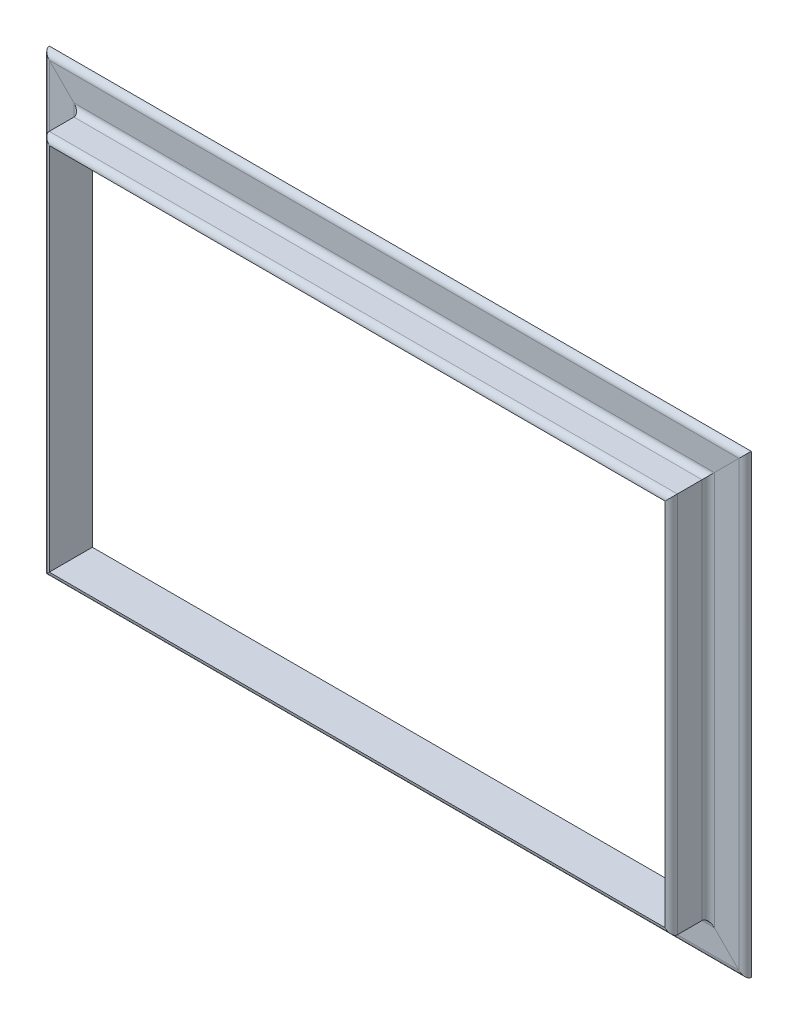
ISO-10303-21;
HEADER;
FILE_DESCRIPTION(('STEP AP214'),'2;1');
FILE_NAME('part.step','',(''),(''),'','','');
FILE_SCHEMA(('AUTOMOTIVE_DESIGN { 1 0 10303 214 1 1 1 1 }'));
ENDSEC;
DATA;
#1=APPLICATION_CONTEXT('core data for automotive mechanical design processes');
#2=APPLICATION_PROTOCOL_DEFINITION('international standard','automotive_design',2000,#1);
#3=PRODUCT_CONTEXT('',#1,'mechanical');
#4=PRODUCT('Part','Part','',(#3));
#5=PRODUCT_RELATED_PRODUCT_CATEGORY('part','',(#4));
#6=PRODUCT_DEFINITION_FORMATION('','',#4);
#7=PRODUCT_DEFINITION_CONTEXT('part definition',#1,'design');
#8=PRODUCT_DEFINITION('design','',#6,#7);
#9=PRODUCT_DEFINITION_SHAPE('','',#8);
#10=(LENGTH_UNIT() NAMED_UNIT(*) SI_UNIT(.MILLI.,.METRE.));
#11=(NAMED_UNIT(*) PLANE_ANGLE_UNIT() SI_UNIT($,.RADIAN.));
#12=(NAMED_UNIT(*) SI_UNIT($,.STERADIAN.) SOLID_ANGLE_UNIT());
#13=UNCERTAINTY_MEASURE_WITH_UNIT(LENGTH_MEASURE(1.E-05),#10,'distance_accuracy_value','');
#14=(GEOMETRIC_REPRESENTATION_CONTEXT(3) GLOBAL_UNCERTAINTY_ASSIGNED_CONTEXT((#13)) GLOBAL_UNIT_ASSIGNED_CONTEXT((#10,
#11,#12)) REPRESENTATION_CONTEXT('',''));
#15=CARTESIAN_POINT('',(0.,0.,0.));
#16=DIRECTION('',(0.,0.,1.));
#17=DIRECTION('',(1.,0.,0.));
#18=AXIS2_PLACEMENT_3D('',#15,#16,#17);
#19=CARTESIAN_POINT('',(-250.,-185.,0.));
#20=DIRECTION('',(0.,0.,1.));
#21=DIRECTION('',(1.,0.,0.));
#22=AXIS2_PLACEMENT_3D('',#19,#20,#21);
#23=PLANE('',#22);
#24=DIRECTION('',(-0.707106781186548,0.707106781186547,0.));
#25=VECTOR('',#24,1.);
#26=CARTESIAN_POINT('',(17.5,82.5,0.));
#27=LINE('',#26,#25);
#28=CARTESIAN_POINT('',(285.,-185.,0.));
#29=VERTEX_POINT('',#28);
#30=CARTESIAN_POINT('',(250.,-150.,0.));
#31=VERTEX_POINT('',#30);
#32=EDGE_CURVE('E142',#29,#31,#27,.T.);
#33=ORIENTED_EDGE('',*,*,#32,.F.);
#34=DIRECTION('',(1.,0.,0.));
#35=VECTOR('',#34,1.);
#36=CARTESIAN_POINT('',(-250.,-185.,0.));
#37=LINE('',#36,#35);
#38=CARTESIAN_POINT('',(-285.,-185.,0.));
#39=VERTEX_POINT('',#38);
#40=EDGE_CURVE('E167',#39,#29,#37,.T.);
#41=ORIENTED_EDGE('',*,*,#40,.F.);
#42=DIRECTION('',(-0.707106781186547,-0.707106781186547,0.));
#43=VECTOR('',#42,1.);
#44=CARTESIAN_POINT('',(-267.5,-167.5,0.));
#45=LINE('',#44,#43);
#46=CARTESIAN_POINT('',(-250.,-150.,0.));
#47=VERTEX_POINT('',#46);
#48=EDGE_CURVE('E133',#47,#39,#45,.T.);
#49=ORIENTED_EDGE('',*,*,#48,.F.);
#50=DIRECTION('',(1.,0.,0.));
#51=VECTOR('',#50,1.);
#52=CARTESIAN_POINT('',(-250.,-150.,0.));
#53=LINE('',#52,#51);
#54=EDGE_CURVE('E76',#47,#31,#53,.T.);
#55=ORIENTED_EDGE('',*,*,#54,.T.);
#56=EDGE_LOOP('',(#33,#41,#49,#55));
#57=FACE_BOUND('',#56,.T.);
#58=ADVANCED_FACE('F72',(#57),#23,.F.);
#59=CARTESIAN_POINT('',(-250.,-180.,0.));
#60=DIRECTION('',(1.,0.,0.));
#61=DIRECTION('',(0.,0.,-1.));
#62=AXIS2_PLACEMENT_3D('',#59,#60,#61);
#63=CYLINDRICAL_SURFACE('',#62,5.);
#64=CARTESIAN_POINT('',(280.,-180.,0.));
#65=DIRECTION('',(0.707106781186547,0.707106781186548,0.));
#66=DIRECTION('',(0.707106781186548,-0.707106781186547,0.));
#67=AXIS2_PLACEMENT_3D('',#64,#65,#66);
#68=ELLIPSE('',#67,7.07106781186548,5.);
#69=CARTESIAN_POINT('',(280.,-180.,5.));
#70=VERTEX_POINT('',#69);
#71=EDGE_CURVE('E139',#70,#29,#68,.T.);
#72=ORIENTED_EDGE('',*,*,#71,.F.);
#73=DIRECTION('',(1.,0.,0.));
#74=VECTOR('',#73,1.);
#75=CARTESIAN_POINT('',(-250.,-180.,5.));
#76=LINE('',#75,#74);
#77=CARTESIAN_POINT('',(-280.,-180.,5.));
#78=VERTEX_POINT('',#77);
#79=EDGE_CURVE('E165',#78,#70,#76,.T.);
#80=ORIENTED_EDGE('',*,*,#79,.F.);
#81=CARTESIAN_POINT('',(-280.,-180.,0.));
#82=DIRECTION('',(-0.707106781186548,0.707106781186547,0.));
#83=DIRECTION('',(0.707106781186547,0.707106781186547,0.));
#84=AXIS2_PLACEMENT_3D('',#81,#82,#83);
#85=ELLIPSE('',#84,7.07106781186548,5.);
#86=EDGE_CURVE('E189',#39,#78,#85,.T.);
#87=ORIENTED_EDGE('',*,*,#86,.F.);
#88=ORIENTED_EDGE('',*,*,#40,.T.);
#89=EDGE_LOOP('',(#72,#80,#87,#88));
#90=FACE_BOUND('',#89,.T.);
#91=ADVANCED_FACE('F181',(#90),#63,.T.);
#92=CARTESIAN_POINT('',(-250.,-160.,5.));
#93=DIRECTION('',(0.,0.,-1.));
#94=DIRECTION('',(0.,1.,0.));
#95=AXIS2_PLACEMENT_3D('',#92,#93,#94);
#96=PLANE('',#95);
#97=DIRECTION('',(0.707106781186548,-0.707106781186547,0.));
#98=VECTOR('',#97,1.);
#99=CARTESIAN_POINT('',(5.00000000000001,95.0000000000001,4.99999999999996));
#100=LINE('',#99,#98);
#101=CARTESIAN_POINT('',(260.,-160.,4.99999999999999));
#102=VERTEX_POINT('',#101);
#103=EDGE_CURVE('E14',#102,#70,#100,.T.);
#104=ORIENTED_EDGE('',*,*,#103,.F.);
#105=DIRECTION('',(1.,0.,0.));
#106=VECTOR('',#105,1.);
#107=CARTESIAN_POINT('',(-250.,-160.,5.));
#108=LINE('',#107,#106);
#109=CARTESIAN_POINT('',(-260.,-160.,5.));
#110=VERTEX_POINT('',#109);
#111=EDGE_CURVE('E162',#110,#102,#108,.T.);
#112=ORIENTED_EDGE('',*,*,#111,.F.);
#113=DIRECTION('',(0.707106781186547,0.707106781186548,0.));
#114=VECTOR('',#113,1.);
#115=CARTESIAN_POINT('',(-255.,-155.,5.));
#116=LINE('',#115,#114);
#117=EDGE_CURVE('E188',#78,#110,#116,.T.);
#118=ORIENTED_EDGE('',*,*,#117,.F.);
#119=ORIENTED_EDGE('',*,*,#79,.T.);
#120=EDGE_LOOP('',(#104,#112,#118,#119));
#121=FACE_BOUND('',#120,.T.);
#122=ADVANCED_FACE('F185',(#121),#96,.F.);
#123=CARTESIAN_POINT('',(-250.,-160.,10.));
#124=DIRECTION('',(1.,0.,0.));
#125=DIRECTION('',(0.,0.,-1.));
#126=AXIS2_PLACEMENT_3D('',#123,#124,#125);
#127=CYLINDRICAL_SURFACE('',#126,5.);
#128=CARTESIAN_POINT('',(260.,-160.,10.));
#129=DIRECTION('',(0.707106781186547,0.707106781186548,0.));
#130=DIRECTION('',(0.707106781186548,-0.707106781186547,0.));
#131=AXIS2_PLACEMENT_3D('',#128,#129,#130);
#132=ELLIPSE('',#131,7.07106781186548,5.);
#133=CARTESIAN_POINT('',(255.,-155.,10.));
#134=VERTEX_POINT('',#133);
#135=EDGE_CURVE('E81',#134,#102,#132,.F.);
#136=ORIENTED_EDGE('',*,*,#135,.F.);
#137=DIRECTION('',(1.,0.,0.));
#138=VECTOR('',#137,1.);
#139=CARTESIAN_POINT('',(-250.,-155.,10.));
#140=LINE('',#139,#138);
#141=CARTESIAN_POINT('',(-255.,-155.,10.));
#142=VERTEX_POINT('',#141);
#143=EDGE_CURVE('E159',#142,#134,#140,.T.);
#144=ORIENTED_EDGE('',*,*,#143,.F.);
#145=CARTESIAN_POINT('',(-260.,-160.,10.));
#146=DIRECTION('',(-0.707106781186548,0.707106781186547,0.));
#147=DIRECTION('',(0.707106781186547,0.707106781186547,0.));
#148=AXIS2_PLACEMENT_3D('',#145,#146,#147);
#149=ELLIPSE('',#148,7.07106781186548,5.);
#150=EDGE_CURVE('E144',#110,#142,#149,.F.);
#151=ORIENTED_EDGE('',*,*,#150,.F.);
#152=ORIENTED_EDGE('',*,*,#111,.T.);
#153=EDGE_LOOP('',(#136,#144,#151,#152));
#154=FACE_BOUND('',#153,.T.);
#155=ADVANCED_FACE('F196',(#154),#127,.F.);
#156=CARTESIAN_POINT('',(-250.,-155.,30.));
#157=DIRECTION('',(0.,1.,0.));
#158=DIRECTION('',(0.,0.,1.));
#159=AXIS2_PLACEMENT_3D('',#156,#157,#158);
#160=PLANE('',#159);
#161=DIRECTION('',(0.,0.,-1.));
#162=VECTOR('',#161,1.);
#163=CARTESIAN_POINT('',(255.,-155.,30.));
#164=LINE('',#163,#162);
#165=CARTESIAN_POINT('',(255.,-155.,30.));
#166=VERTEX_POINT('',#165);
#167=EDGE_CURVE('E153',#166,#134,#164,.T.);
#168=ORIENTED_EDGE('',*,*,#167,.F.);
#169=DIRECTION('',(1.,0.,0.));
#170=VECTOR('',#169,1.);
#171=CARTESIAN_POINT('',(-250.,-155.,30.));
#172=LINE('',#171,#170);
#173=CARTESIAN_POINT('',(-255.,-155.,30.));
#174=VERTEX_POINT('',#173);
#175=EDGE_CURVE('E127',#174,#166,#172,.T.);
#176=ORIENTED_EDGE('',*,*,#175,.F.);
#177=DIRECTION('',(0.,0.,1.));
#178=VECTOR('',#177,1.);
#179=CARTESIAN_POINT('',(-255.,-155.,30.));
#180=LINE('',#179,#178);
#181=EDGE_CURVE('E138',#142,#174,#180,.T.);
#182=ORIENTED_EDGE('',*,*,#181,.F.);
#183=ORIENTED_EDGE('',*,*,#143,.T.);
#184=EDGE_LOOP('',(#168,#176,#182,#183));
#185=FACE_BOUND('',#184,.T.);
#186=ADVANCED_FACE('F199',(#185),#160,.F.);
#187=CARTESIAN_POINT('',(-250.,-150.,30.));
#188=DIRECTION('',(1.,0.,0.));
#189=DIRECTION('',(0.,0.,-1.));
#190=AXIS2_PLACEMENT_3D('',#187,#188,#189);
#191=CYLINDRICAL_SURFACE('',#190,5.);
#192=CARTESIAN_POINT('',(250.,-150.,30.));
#193=DIRECTION('',(0.707106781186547,0.707106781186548,0.));
#194=DIRECTION('',(0.707106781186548,-0.707106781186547,0.));
#195=AXIS2_PLACEMENT_3D('',#192,#193,#194);
#196=ELLIPSE('',#195,7.07106781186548,5.);
#197=CARTESIAN_POINT('',(250.,-150.,35.));
#198=VERTEX_POINT('',#197);
#199=EDGE_CURVE('E124',#198,#166,#196,.T.);
#200=ORIENTED_EDGE('',*,*,#199,.F.);
#201=DIRECTION('',(1.,0.,0.));
#202=VECTOR('',#201,1.);
#203=CARTESIAN_POINT('',(-250.,-150.,35.));
#204=LINE('',#203,#202);
#205=CARTESIAN_POINT('',(-250.,-150.,35.));
#206=VERTEX_POINT('',#205);
#207=EDGE_CURVE('E89',#206,#198,#204,.T.);
#208=ORIENTED_EDGE('',*,*,#207,.F.);
#209=CARTESIAN_POINT('',(-250.,-150.,30.));
#210=DIRECTION('',(-0.707106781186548,0.707106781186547,0.));
#211=DIRECTION('',(0.707106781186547,0.707106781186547,0.));
#212=AXIS2_PLACEMENT_3D('',#209,#210,#211);
#213=ELLIPSE('',#212,7.07106781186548,5.);
#214=EDGE_CURVE('E121',#174,#206,#213,.T.);
#215=ORIENTED_EDGE('',*,*,#214,.F.);
#216=ORIENTED_EDGE('',*,*,#175,.T.);
#217=EDGE_LOOP('',(#200,#208,#215,#216));
#218=FACE_BOUND('',#217,.T.);
#219=ADVANCED_FACE('F118',(#218),#191,.T.);
#220=CARTESIAN_POINT('',(-250.,-150.,0.));
#221=DIRECTION('',(0.,-1.,0.));
#222=DIRECTION('',(0.,0.,-1.));
#223=AXIS2_PLACEMENT_3D('',#220,#221,#222);
#224=PLANE('',#223);
#225=DIRECTION('',(0.,0.,1.));
#226=VECTOR('',#225,1.);
#227=CARTESIAN_POINT('',(250.,-150.,0.));
#228=LINE('',#227,#226);
#229=EDGE_CURVE('E149',#31,#198,#228,.T.);
#230=ORIENTED_EDGE('',*,*,#229,.F.);
#231=ORIENTED_EDGE('',*,*,#54,.F.);
#232=DIRECTION('',(0.,0.,-1.));
#233=VECTOR('',#232,1.);
#234=CARTESIAN_POINT('',(-250.,-150.,0.));
#235=LINE('',#234,#233);
#236=EDGE_CURVE('E126',#206,#47,#235,.T.);
#237=ORIENTED_EDGE('',*,*,#236,.F.);
#238=ORIENTED_EDGE('',*,*,#207,.T.);
#239=EDGE_LOOP('',(#230,#231,#237,#238));
#240=FACE_BOUND('',#239,.T.);
#241=ADVANCED_FACE('F130',(#240),#224,.F.);
#242=CARTESIAN_POINT('',(-250.,-150.,0.));
#243=DIRECTION('',(-0.707106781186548,0.707106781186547,0.));
#244=DIRECTION('',(-0.707106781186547,-0.707106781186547,0.));
#245=AXIS2_PLACEMENT_3D('',#242,#243,#244);
#246=PLANE('',#245);
#247=ORIENTED_EDGE('',*,*,#236,.T.);
#248=ORIENTED_EDGE('',*,*,#48,.T.);
#249=ORIENTED_EDGE('',*,*,#86,.T.);
#250=ORIENTED_EDGE('',*,*,#117,.T.);
#251=ORIENTED_EDGE('',*,*,#150,.T.);
#252=ORIENTED_EDGE('',*,*,#181,.T.);
#253=ORIENTED_EDGE('',*,*,#214,.T.);
#254=EDGE_LOOP('',(#247,#248,#249,#250,#251,#252,#253));
#255=FACE_BOUND('',#254,.T.);
#256=ADVANCED_FACE('F136',(#255),#246,.T.);
#257=CARTESIAN_POINT('',(250.,-150.,0.));
#258=DIRECTION('',(0.707106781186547,0.707106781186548,0.));
#259=DIRECTION('',(-0.707106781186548,0.707106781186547,0.));
#260=AXIS2_PLACEMENT_3D('',#257,#258,#259);
#261=PLANE('',#260);
#262=ORIENTED_EDGE('',*,*,#71,.T.);
#263=ORIENTED_EDGE('',*,*,#32,.T.);
#264=ORIENTED_EDGE('',*,*,#229,.T.);
#265=ORIENTED_EDGE('',*,*,#199,.T.);
#266=ORIENTED_EDGE('',*,*,#167,.T.);
#267=ORIENTED_EDGE('',*,*,#135,.T.);
#268=ORIENTED_EDGE('',*,*,#103,.T.);
#269=EDGE_LOOP('',(#262,#263,#264,#265,#266,#267,#268));
#270=FACE_BOUND('',#269,.T.);
#271=ADVANCED_FACE('F74',(#270),#261,.T.);
#272=CLOSED_SHELL('',(#58,#91,#122,#155,#186,#219,#241,#256,#271));
#273=MANIFOLD_SOLID_BREP('B2',#272);
#274=CARTESIAN_POINT('',(285.,-150.,0.));
#275=DIRECTION('',(0.,0.,1.));
#276=DIRECTION('',(1.,0.,0.));
#277=AXIS2_PLACEMENT_3D('',#274,#275,#276);
#278=PLANE('',#277);
#279=DIRECTION('',(0.707106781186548,-0.707106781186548,0.));
#280=VECTOR('',#279,1.);
#281=CARTESIAN_POINT('',(267.5,-167.5,0.));
#282=LINE('',#281,#280);
#283=CARTESIAN_POINT('',(250.,-150.,0.));
#284=VERTEX_POINT('',#283);
#285=CARTESIAN_POINT('',(285.,-185.,0.));
#286=VERTEX_POINT('',#285);
#287=EDGE_CURVE('E408',#284,#286,#282,.T.);
#288=ORIENTED_EDGE('',*,*,#287,.F.);
#289=DIRECTION('',(0.,1.,0.));
#290=VECTOR('',#289,1.);
#291=CARTESIAN_POINT('',(250.,-150.,0.));
#292=LINE('',#291,#290);
#293=CARTESIAN_POINT('',(250.,150.,0.));
#294=VERTEX_POINT('',#293);
#295=EDGE_CURVE('E322',#284,#294,#292,.T.);
#296=ORIENTED_EDGE('',*,*,#295,.T.);
#297=DIRECTION('',(-0.707106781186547,-0.707106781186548,0.));
#298=VECTOR('',#297,1.);
#299=CARTESIAN_POINT('',(117.5,17.5,0.));
#300=LINE('',#299,#298);
#301=CARTESIAN_POINT('',(285.,185.,0.));
#302=VERTEX_POINT('',#301);
#303=EDGE_CURVE('E425',#302,#294,#300,.T.);
#304=ORIENTED_EDGE('',*,*,#303,.F.);
#305=DIRECTION('',(0.,1.,0.));
#306=VECTOR('',#305,1.);
#307=CARTESIAN_POINT('',(285.,-150.,0.));
#308=LINE('',#307,#306);
#309=EDGE_CURVE('E419',#286,#302,#308,.T.);
#310=ORIENTED_EDGE('',*,*,#309,.F.);
#311=EDGE_LOOP('',(#288,#296,#304,#310));
#312=FACE_BOUND('',#311,.T.);
#313=ADVANCED_FACE('F318',(#312),#278,.F.);
#314=CARTESIAN_POINT('',(280.,-150.,0.));
#315=DIRECTION('',(0.,1.,0.));
#316=DIRECTION('',(0.,0.,1.));
#317=AXIS2_PLACEMENT_3D('',#314,#315,#316);
#318=CYLINDRICAL_SURFACE('',#317,5.);
#319=CARTESIAN_POINT('',(280.,-180.,0.));
#320=DIRECTION('',(-0.707106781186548,-0.707106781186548,0.));
#321=DIRECTION('',(-0.707106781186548,0.707106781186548,0.));
#322=AXIS2_PLACEMENT_3D('',#319,#320,#321);
#323=ELLIPSE('',#322,7.07106781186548,5.);
#324=CARTESIAN_POINT('',(280.,-180.,5.));
#325=VERTEX_POINT('',#324);
#326=EDGE_CURVE('E373',#286,#325,#323,.T.);
#327=ORIENTED_EDGE('',*,*,#326,.F.);
#328=ORIENTED_EDGE('',*,*,#309,.T.);
#329=CARTESIAN_POINT('',(280.,180.,0.));
#330=DIRECTION('',(-0.707106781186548,0.707106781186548,0.));
#331=DIRECTION('',(0.707106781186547,0.707106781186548,0.));
#332=AXIS2_PLACEMENT_3D('',#329,#330,#331);
#333=ELLIPSE('',#332,7.07106781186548,5.);
#334=CARTESIAN_POINT('',(280.,180.,5.));
#335=VERTEX_POINT('',#334);
#336=EDGE_CURVE('E415',#335,#302,#333,.T.);
#337=ORIENTED_EDGE('',*,*,#336,.F.);
#338=DIRECTION('',(0.,1.,0.));
#339=VECTOR('',#338,1.);
#340=CARTESIAN_POINT('',(280.,-150.,5.));
#341=LINE('',#340,#339);
#342=EDGE_CURVE('E418',#325,#335,#341,.T.);
#343=ORIENTED_EDGE('',*,*,#342,.F.);
#344=EDGE_LOOP('',(#327,#328,#337,#343));
#345=FACE_BOUND('',#344,.T.);
#346=ADVANCED_FACE('F421',(#345),#318,.T.);
#347=CARTESIAN_POINT('',(260.,-150.,5.));
#348=DIRECTION('',(0.,0.,-1.));
#349=DIRECTION('',(-1.,0.,0.));
#350=AXIS2_PLACEMENT_3D('',#347,#348,#349);
#351=PLANE('',#350);
#352=DIRECTION('',(-0.707106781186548,0.707106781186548,0.));
#353=VECTOR('',#352,1.);
#354=CARTESIAN_POINT('',(255.,-155.,5.));
#355=LINE('',#354,#353);
#356=CARTESIAN_POINT('',(260.,-160.,4.99999999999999));
#357=VERTEX_POINT('',#356);
#358=EDGE_CURVE('E403',#325,#357,#355,.T.);
#359=ORIENTED_EDGE('',*,*,#358,.F.);
#360=ORIENTED_EDGE('',*,*,#342,.T.);
#361=DIRECTION('',(0.707106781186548,0.707106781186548,0.));
#362=VECTOR('',#361,1.);
#363=CARTESIAN_POINT('',(105.,4.99999999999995,4.99999999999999));
#364=LINE('',#363,#362);
#365=CARTESIAN_POINT('',(260.,160.,4.99999999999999));
#366=VERTEX_POINT('',#365);
#367=EDGE_CURVE('E413',#366,#335,#364,.T.);
#368=ORIENTED_EDGE('',*,*,#367,.F.);
#369=DIRECTION('',(0.,1.,0.));
#370=VECTOR('',#369,1.);
#371=CARTESIAN_POINT('',(260.,-150.,4.99999999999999));
#372=LINE('',#371,#370);
#373=EDGE_CURVE('E399',#357,#366,#372,.T.);
#374=ORIENTED_EDGE('',*,*,#373,.F.);
#375=EDGE_LOOP('',(#359,#360,#368,#374));
#376=FACE_BOUND('',#375,.T.);
#377=ADVANCED_FACE('F456',(#376),#351,.F.);
#378=CARTESIAN_POINT('',(260.,-150.,10.));
#379=DIRECTION('',(0.,1.,0.));
#380=DIRECTION('',(0.,0.,1.));
#381=AXIS2_PLACEMENT_3D('',#378,#379,#380);
#382=CYLINDRICAL_SURFACE('',#381,5.);
#383=CARTESIAN_POINT('',(260.,-160.,10.));
#384=DIRECTION('',(-0.707106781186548,-0.707106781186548,0.));
#385=DIRECTION('',(-0.707106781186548,0.707106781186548,0.));
#386=AXIS2_PLACEMENT_3D('',#383,#384,#385);
#387=ELLIPSE('',#386,7.07106781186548,5.);
#388=CARTESIAN_POINT('',(255.,-155.,10.));
#389=VERTEX_POINT('',#388);
#390=EDGE_CURVE('E391',#357,#389,#387,.F.);
#391=ORIENTED_EDGE('',*,*,#390,.F.);
#392=ORIENTED_EDGE('',*,*,#373,.T.);
#393=CARTESIAN_POINT('',(260.,160.,10.));
#394=DIRECTION('',(-0.707106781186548,0.707106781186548,0.));
#395=DIRECTION('',(0.707106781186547,0.707106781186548,0.));
#396=AXIS2_PLACEMENT_3D('',#393,#394,#395);
#397=ELLIPSE('',#396,7.07106781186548,5.);
#398=CARTESIAN_POINT('',(255.,155.,10.));
#399=VERTEX_POINT('',#398);
#400=EDGE_CURVE('E397',#399,#366,#397,.F.);
#401=ORIENTED_EDGE('',*,*,#400,.F.);
#402=DIRECTION('',(0.,1.,0.));
#403=VECTOR('',#402,1.);
#404=CARTESIAN_POINT('',(255.,-150.,10.));
#405=LINE('',#404,#403);
#406=EDGE_CURVE('E386',#389,#399,#405,.T.);
#407=ORIENTED_EDGE('',*,*,#406,.F.);
#408=EDGE_LOOP('',(#391,#392,#401,#407));
#409=FACE_BOUND('',#408,.T.);
#410=ADVANCED_FACE('F394',(#409),#382,.F.);
#411=CARTESIAN_POINT('',(255.,-150.,30.));
#412=DIRECTION('',(-1.,0.,0.));
#413=DIRECTION('',(0.,0.,1.));
#414=AXIS2_PLACEMENT_3D('',#411,#412,#413);
#415=PLANE('',#414);
#416=DIRECTION('',(0.,0.,1.));
#417=VECTOR('',#416,1.);
#418=CARTESIAN_POINT('',(255.,-155.,30.));
#419=LINE('',#418,#417);
#420=CARTESIAN_POINT('',(255.,-155.,30.));
#421=VERTEX_POINT('',#420);
#422=EDGE_CURVE('E327',#389,#421,#419,.T.);
#423=ORIENTED_EDGE('',*,*,#422,.F.);
#424=ORIENTED_EDGE('',*,*,#406,.T.);
#425=DIRECTION('',(0.,0.,-1.));
#426=VECTOR('',#425,1.);
#427=CARTESIAN_POINT('',(255.,155.,30.));
#428=LINE('',#427,#426);
#429=CARTESIAN_POINT('',(255.,155.,30.));
#430=VERTEX_POINT('',#429);
#431=EDGE_CURVE('E436',#430,#399,#428,.T.);
#432=ORIENTED_EDGE('',*,*,#431,.F.);
#433=DIRECTION('',(0.,1.,0.));
#434=VECTOR('',#433,1.);
#435=CARTESIAN_POINT('',(255.,-150.,30.));
#436=LINE('',#435,#434);
#437=EDGE_CURVE('E388',#421,#430,#436,.T.);
#438=ORIENTED_EDGE('',*,*,#437,.F.);
#439=EDGE_LOOP('',(#423,#424,#432,#438));
#440=FACE_BOUND('',#439,.T.);
#441=ADVANCED_FACE('F384',(#440),#415,.F.);
#442=CARTESIAN_POINT('',(250.,-150.,30.));
#443=DIRECTION('',(0.,1.,0.));
#444=DIRECTION('',(0.,0.,1.));
#445=AXIS2_PLACEMENT_3D('',#442,#443,#444);
#446=CYLINDRICAL_SURFACE('',#445,5.);
#447=CARTESIAN_POINT('',(250.,-150.,30.));
#448=DIRECTION('',(-0.707106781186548,-0.707106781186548,0.));
#449=DIRECTION('',(-0.707106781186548,0.707106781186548,0.));
#450=AXIS2_PLACEMENT_3D('',#447,#448,#449);
#451=ELLIPSE('',#450,7.07106781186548,5.);
#452=CARTESIAN_POINT('',(250.,-150.,35.));
#453=VERTEX_POINT('',#452);
#454=EDGE_CURVE('E70',#421,#453,#451,.T.);
#455=ORIENTED_EDGE('',*,*,#454,.F.);
#456=ORIENTED_EDGE('',*,*,#437,.T.);
#457=CARTESIAN_POINT('',(250.,150.,30.));
#458=DIRECTION('',(-0.707106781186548,0.707106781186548,0.));
#459=DIRECTION('',(0.707106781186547,0.707106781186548,0.));
#460=AXIS2_PLACEMENT_3D('',#457,#458,#459);
#461=ELLIPSE('',#460,7.07106781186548,5.);
#462=CARTESIAN_POINT('',(250.,150.,35.));
#463=VERTEX_POINT('',#462);
#464=EDGE_CURVE('E438',#463,#430,#461,.T.);
#465=ORIENTED_EDGE('',*,*,#464,.F.);
#466=DIRECTION('',(0.,1.,0.));
#467=VECTOR('',#466,1.);
#468=CARTESIAN_POINT('',(250.,-150.,35.));
#469=LINE('',#468,#467);
#470=EDGE_CURVE('E340',#453,#463,#469,.T.);
#471=ORIENTED_EDGE('',*,*,#470,.F.);
#472=EDGE_LOOP('',(#455,#456,#465,#471));
#473=FACE_BOUND('',#472,.T.);
#474=ADVANCED_FACE('F443',(#473),#446,.T.);
#475=CARTESIAN_POINT('',(250.,-150.,0.));
#476=DIRECTION('',(1.,0.,0.));
#477=DIRECTION('',(0.,0.,-1.));
#478=AXIS2_PLACEMENT_3D('',#475,#476,#477);
#479=PLANE('',#478);
#480=DIRECTION('',(0.,0.,-1.));
#481=VECTOR('',#480,1.);
#482=CARTESIAN_POINT('',(250.,-150.,0.));
#483=LINE('',#482,#481);
#484=EDGE_CURVE('E411',#453,#284,#483,.T.);
#485=ORIENTED_EDGE('',*,*,#484,.F.);
#486=ORIENTED_EDGE('',*,*,#470,.T.);
#487=DIRECTION('',(0.,0.,1.));
#488=VECTOR('',#487,1.);
#489=CARTESIAN_POINT('',(250.,150.,0.));
#490=LINE('',#489,#488);
#491=EDGE_CURVE('E428',#294,#463,#490,.T.);
#492=ORIENTED_EDGE('',*,*,#491,.F.);
#493=ORIENTED_EDGE('',*,*,#295,.F.);
#494=EDGE_LOOP('',(#485,#486,#492,#493));
#495=FACE_BOUND('',#494,.T.);
#496=ADVANCED_FACE('F441',(#495),#479,.F.);
#497=CARTESIAN_POINT('',(250.,150.,0.));
#498=DIRECTION('',(-0.707106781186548,0.707106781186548,0.));
#499=DIRECTION('',(-0.707106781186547,-0.707106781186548,0.));
#500=AXIS2_PLACEMENT_3D('',#497,#498,#499);
#501=PLANE('',#500);
#502=ORIENTED_EDGE('',*,*,#336,.T.);
#503=ORIENTED_EDGE('',*,*,#303,.T.);
#504=ORIENTED_EDGE('',*,*,#491,.T.);
#505=ORIENTED_EDGE('',*,*,#464,.T.);
#506=ORIENTED_EDGE('',*,*,#431,.T.);
#507=ORIENTED_EDGE('',*,*,#400,.T.);
#508=ORIENTED_EDGE('',*,*,#367,.T.);
#509=EDGE_LOOP('',(#502,#503,#504,#505,#506,#507,#508));
#510=FACE_BOUND('',#509,.T.);
#511=ADVANCED_FACE('F430',(#510),#501,.T.);
#512=CARTESIAN_POINT('',(250.,-150.,0.));
#513=DIRECTION('',(-0.707106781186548,-0.707106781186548,0.));
#514=DIRECTION('',(0.707106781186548,-0.707106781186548,0.));
#515=AXIS2_PLACEMENT_3D('',#512,#513,#514);
#516=PLANE('',#515);
#517=ORIENTED_EDGE('',*,*,#484,.T.);
#518=ORIENTED_EDGE('',*,*,#287,.T.);
#519=ORIENTED_EDGE('',*,*,#326,.T.);
#520=ORIENTED_EDGE('',*,*,#358,.T.);
#521=ORIENTED_EDGE('',*,*,#390,.T.);
#522=ORIENTED_EDGE('',*,*,#422,.T.);
#523=ORIENTED_EDGE('',*,*,#454,.T.);
#524=EDGE_LOOP('',(#517,#518,#519,#520,#521,#522,#523));
#525=FACE_BOUND('',#524,.T.);
#526=ADVANCED_FACE('F320',(#525),#516,.T.);
#527=CLOSED_SHELL('',(#313,#346,#377,#410,#441,#474,#496,#511,#526));
#528=MANIFOLD_SOLID_BREP('B8',#527);
#529=CARTESIAN_POINT('',(-285.,150.,0.));
#530=DIRECTION('',(0.,0.,1.));
#531=DIRECTION('',(1.,0.,0.));
#532=AXIS2_PLACEMENT_3D('',#529,#530,#531);
#533=PLANE('',#532);
#534=DIRECTION('',(0.707106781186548,0.707106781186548,0.));
#535=VECTOR('',#534,1.);
#536=CARTESIAN_POINT('',(-117.5,-17.5,0.));
#537=LINE('',#536,#535);
#538=CARTESIAN_POINT('',(-285.,-185.,0.));
#539=VERTEX_POINT('',#538);
#540=CARTESIAN_POINT('',(-250.,-150.,0.));
#541=VERTEX_POINT('',#540);
#542=EDGE_CURVE('E633',#539,#541,#537,.T.);
#543=ORIENTED_EDGE('',*,*,#542,.F.);
#544=DIRECTION('',(0.,-1.,0.));
#545=VECTOR('',#544,1.);
#546=CARTESIAN_POINT('',(-285.,150.,0.));
#547=LINE('',#546,#545);
#548=CARTESIAN_POINT('',(-285.,185.,0.));
#549=VERTEX_POINT('',#548);
#550=EDGE_CURVE('E658',#549,#539,#547,.T.);
#551=ORIENTED_EDGE('',*,*,#550,.F.);
#552=DIRECTION('',(-0.707106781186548,0.707106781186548,0.));
#553=VECTOR('',#552,1.);
#554=CARTESIAN_POINT('',(-267.5,167.5,0.));
#555=LINE('',#554,#553);
#556=CARTESIAN_POINT('',(-250.,150.,0.));
#557=VERTEX_POINT('',#556);
#558=EDGE_CURVE('E624',#557,#549,#555,.T.);
#559=ORIENTED_EDGE('',*,*,#558,.F.);
#560=DIRECTION('',(0.,-1.,0.));
#561=VECTOR('',#560,1.);
#562=CARTESIAN_POINT('',(-250.,150.,0.));
#563=LINE('',#562,#561);
#564=EDGE_CURVE('E567',#557,#541,#563,.T.);
#565=ORIENTED_EDGE('',*,*,#564,.T.);
#566=EDGE_LOOP('',(#543,#551,#559,#565));
#567=FACE_BOUND('',#566,.T.);
#568=ADVANCED_FACE('F563',(#567),#533,.F.);
#569=CARTESIAN_POINT('',(-280.,150.,0.));
#570=DIRECTION('',(0.,-1.,0.));
#571=DIRECTION('',(0.,0.,-1.));
#572=AXIS2_PLACEMENT_3D('',#569,#570,#571);
#573=CYLINDRICAL_SURFACE('',#572,5.);
#574=CARTESIAN_POINT('',(-280.,-180.,0.));
#575=DIRECTION('',(0.707106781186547,-0.707106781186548,0.));
#576=DIRECTION('',(-0.707106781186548,-0.707106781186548,0.));
#577=AXIS2_PLACEMENT_3D('',#574,#575,#576);
#578=ELLIPSE('',#577,7.07106781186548,5.);
#579=CARTESIAN_POINT('',(-280.,-180.,5.));
#580=VERTEX_POINT('',#579);
#581=EDGE_CURVE('E630',#580,#539,#578,.T.);
#582=ORIENTED_EDGE('',*,*,#581,.F.);
#583=DIRECTION('',(0.,-1.,0.));
#584=VECTOR('',#583,1.);
#585=CARTESIAN_POINT('',(-280.,150.,5.));
#586=LINE('',#585,#584);
#587=CARTESIAN_POINT('',(-280.,180.,5.));
#588=VERTEX_POINT('',#587);
#589=EDGE_CURVE('E656',#588,#580,#586,.T.);
#590=ORIENTED_EDGE('',*,*,#589,.F.);
#591=CARTESIAN_POINT('',(-280.,180.,0.));
#592=DIRECTION('',(0.707106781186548,0.707106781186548,0.));
#593=DIRECTION('',(0.707106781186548,-0.707106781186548,0.));
#594=AXIS2_PLACEMENT_3D('',#591,#592,#593);
#595=ELLIPSE('',#594,7.07106781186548,5.);
#596=EDGE_CURVE('E680',#549,#588,#595,.T.);
#597=ORIENTED_EDGE('',*,*,#596,.F.);
#598=ORIENTED_EDGE('',*,*,#550,.T.);
#599=EDGE_LOOP('',(#582,#590,#597,#598));
#600=FACE_BOUND('',#599,.T.);
#601=ADVANCED_FACE('F672',(#600),#573,.T.);
#602=CARTESIAN_POINT('',(-260.,150.,5.));
#603=DIRECTION('',(0.,0.,-1.));
#604=DIRECTION('',(-1.,0.,0.));
#605=AXIS2_PLACEMENT_3D('',#602,#603,#604);
#606=PLANE('',#605);
#607=DIRECTION('',(-0.707106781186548,-0.707106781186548,0.));
#608=VECTOR('',#607,1.);
#609=CARTESIAN_POINT('',(-105.,-5.00000000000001,5.));
#610=LINE('',#609,#608);
#611=CARTESIAN_POINT('',(-260.,-160.,4.99999999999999));
#612=VERTEX_POINT('',#611);
#613=EDGE_CURVE('E316',#612,#580,#610,.T.);
#614=ORIENTED_EDGE('',*,*,#613,.F.);
#615=DIRECTION('',(0.,-1.,0.));
#616=VECTOR('',#615,1.);
#617=CARTESIAN_POINT('',(-260.,150.,4.99999999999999));
#618=LINE('',#617,#616);
#619=CARTESIAN_POINT('',(-260.,160.,5.));
#620=VERTEX_POINT('',#619);
#621=EDGE_CURVE('E653',#620,#612,#618,.T.);
#622=ORIENTED_EDGE('',*,*,#621,.F.);
#623=DIRECTION('',(0.707106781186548,-0.707106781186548,0.));
#624=VECTOR('',#623,1.);
#625=CARTESIAN_POINT('',(-255.,155.,5.));
#626=LINE('',#625,#624);
#627=EDGE_CURVE('E679',#588,#620,#626,.T.);
#628=ORIENTED_EDGE('',*,*,#627,.F.);
#629=ORIENTED_EDGE('',*,*,#589,.T.);
#630=EDGE_LOOP('',(#614,#622,#628,#629));
#631=FACE_BOUND('',#630,.T.);
#632=ADVANCED_FACE('F676',(#631),#606,.F.);
#633=CARTESIAN_POINT('',(-260.,150.,10.));
#634=DIRECTION('',(0.,-1.,0.));
#635=DIRECTION('',(0.,0.,-1.));
#636=AXIS2_PLACEMENT_3D('',#633,#634,#635);
#637=CYLINDRICAL_SURFACE('',#636,5.);
#638=CARTESIAN_POINT('',(-260.,-160.,10.));
#639=DIRECTION('',(0.707106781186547,-0.707106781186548,0.));
#640=DIRECTION('',(-0.707106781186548,-0.707106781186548,0.));
#641=AXIS2_PLACEMENT_3D('',#638,#639,#640);
#642=ELLIPSE('',#641,7.07106781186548,5.);
#643=CARTESIAN_POINT('',(-255.,-155.,10.));
#644=VERTEX_POINT('',#643);
#645=EDGE_CURVE('E572',#644,#612,#642,.F.);
#646=ORIENTED_EDGE('',*,*,#645,.F.);
#647=DIRECTION('',(0.,-1.,0.));
#648=VECTOR('',#647,1.);
#649=CARTESIAN_POINT('',(-255.,150.,10.));
#650=LINE('',#649,#648);
#651=CARTESIAN_POINT('',(-255.,155.,10.));
#652=VERTEX_POINT('',#651);
#653=EDGE_CURVE('E650',#652,#644,#650,.T.);
#654=ORIENTED_EDGE('',*,*,#653,.F.);
#655=CARTESIAN_POINT('',(-260.,160.,10.));
#656=DIRECTION('',(0.707106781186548,0.707106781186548,0.));
#657=DIRECTION('',(0.707106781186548,-0.707106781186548,0.));
#658=AXIS2_PLACEMENT_3D('',#655,#656,#657);
#659=ELLIPSE('',#658,7.07106781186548,5.);
#660=EDGE_CURVE('E635',#620,#652,#659,.F.);
#661=ORIENTED_EDGE('',*,*,#660,.F.);
#662=ORIENTED_EDGE('',*,*,#621,.T.);
#663=EDGE_LOOP('',(#646,#654,#661,#662));
#664=FACE_BOUND('',#663,.T.);
#665=ADVANCED_FACE('F687',(#664),#637,.F.);
#666=CARTESIAN_POINT('',(-255.,150.,30.));
#667=DIRECTION('',(1.,0.,0.));
#668=DIRECTION('',(0.,0.,-1.));
#669=AXIS2_PLACEMENT_3D('',#666,#667,#668);
#670=PLANE('',#669);
#671=DIRECTION('',(0.,0.,-1.));
#672=VECTOR('',#671,1.);
#673=CARTESIAN_POINT('',(-255.,-155.,30.));
#674=LINE('',#673,#672);
#675=CARTESIAN_POINT('',(-255.,-155.,30.));
#676=VERTEX_POINT('',#675);
#677=EDGE_CURVE('E644',#676,#644,#674,.T.);
#678=ORIENTED_EDGE('',*,*,#677,.F.);
#679=DIRECTION('',(0.,-1.,0.));
#680=VECTOR('',#679,1.);
#681=CARTESIAN_POINT('',(-255.,150.,30.));
#682=LINE('',#681,#680);
#683=CARTESIAN_POINT('',(-255.,155.,30.));
#684=VERTEX_POINT('',#683);
#685=EDGE_CURVE('E618',#684,#676,#682,.T.);
#686=ORIENTED_EDGE('',*,*,#685,.F.);
#687=DIRECTION('',(0.,0.,1.));
#688=VECTOR('',#687,1.);
#689=CARTESIAN_POINT('',(-255.,155.,30.));
#690=LINE('',#689,#688);
#691=EDGE_CURVE('E629',#652,#684,#690,.T.);
#692=ORIENTED_EDGE('',*,*,#691,.F.);
#693=ORIENTED_EDGE('',*,*,#653,.T.);
#694=EDGE_LOOP('',(#678,#686,#692,#693));
#695=FACE_BOUND('',#694,.T.);
#696=ADVANCED_FACE('F690',(#695),#670,.F.);
#697=CARTESIAN_POINT('',(-250.,150.,30.));
#698=DIRECTION('',(0.,-1.,0.));
#699=DIRECTION('',(0.,0.,-1.));
#700=AXIS2_PLACEMENT_3D('',#697,#698,#699);
#701=CYLINDRICAL_SURFACE('',#700,5.);
#702=CARTESIAN_POINT('',(-250.,-150.,30.));
#703=DIRECTION('',(0.707106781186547,-0.707106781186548,0.));
#704=DIRECTION('',(-0.707106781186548,-0.707106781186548,0.));
#705=AXIS2_PLACEMENT_3D('',#702,#703,#704);
#706=ELLIPSE('',#705,7.07106781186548,5.);
#707=CARTESIAN_POINT('',(-250.,-150.,35.));
#708=VERTEX_POINT('',#707);
#709=EDGE_CURVE('E615',#708,#676,#706,.T.);
#710=ORIENTED_EDGE('',*,*,#709,.F.);
#711=DIRECTION('',(0.,-1.,0.));
#712=VECTOR('',#711,1.);
#713=CARTESIAN_POINT('',(-250.,150.,35.));
#714=LINE('',#713,#712);
#715=CARTESIAN_POINT('',(-250.,150.,35.));
#716=VERTEX_POINT('',#715);
#717=EDGE_CURVE('E580',#716,#708,#714,.T.);
#718=ORIENTED_EDGE('',*,*,#717,.F.);
#719=CARTESIAN_POINT('',(-250.,150.,30.));
#720=DIRECTION('',(0.707106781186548,0.707106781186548,0.));
#721=DIRECTION('',(0.707106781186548,-0.707106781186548,0.));
#722=AXIS2_PLACEMENT_3D('',#719,#720,#721);
#723=ELLIPSE('',#722,7.07106781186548,5.);
#724=EDGE_CURVE('E612',#684,#716,#723,.T.);
#725=ORIENTED_EDGE('',*,*,#724,.F.);
#726=ORIENTED_EDGE('',*,*,#685,.T.);
#727=EDGE_LOOP('',(#710,#718,#725,#726));
#728=FACE_BOUND('',#727,.T.);
#729=ADVANCED_FACE('F609',(#728),#701,.T.);
#730=CARTESIAN_POINT('',(-250.,150.,0.));
#731=DIRECTION('',(-1.,0.,0.));
#732=DIRECTION('',(0.,0.,1.));
#733=AXIS2_PLACEMENT_3D('',#730,#731,#732);
#734=PLANE('',#733);
#735=DIRECTION('',(0.,0.,1.));
#736=VECTOR('',#735,1.);
#737=CARTESIAN_POINT('',(-250.,-150.,0.));
#738=LINE('',#737,#736);
#739=EDGE_CURVE('E640',#541,#708,#738,.T.);
#740=ORIENTED_EDGE('',*,*,#739,.F.);
#741=ORIENTED_EDGE('',*,*,#564,.F.);
#742=DIRECTION('',(0.,0.,-1.));
#743=VECTOR('',#742,1.);
#744=CARTESIAN_POINT('',(-250.,150.,0.));
#745=LINE('',#744,#743);
#746=EDGE_CURVE('E617',#716,#557,#745,.T.);
#747=ORIENTED_EDGE('',*,*,#746,.F.);
#748=ORIENTED_EDGE('',*,*,#717,.T.);
#749=EDGE_LOOP('',(#740,#741,#747,#748));
#750=FACE_BOUND('',#749,.T.);
#751=ADVANCED_FACE('F621',(#750),#734,.F.);
#752=CARTESIAN_POINT('',(-250.,150.,0.));
#753=DIRECTION('',(0.707106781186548,0.707106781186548,0.));
#754=DIRECTION('',(-0.707106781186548,0.707106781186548,0.));
#755=AXIS2_PLACEMENT_3D('',#752,#753,#754);
#756=PLANE('',#755);
#757=ORIENTED_EDGE('',*,*,#746,.T.);
#758=ORIENTED_EDGE('',*,*,#558,.T.);
#759=ORIENTED_EDGE('',*,*,#596,.T.);
#760=ORIENTED_EDGE('',*,*,#627,.T.);
#761=ORIENTED_EDGE('',*,*,#660,.T.);
#762=ORIENTED_EDGE('',*,*,#691,.T.);
#763=ORIENTED_EDGE('',*,*,#724,.T.);
#764=EDGE_LOOP('',(#757,#758,#759,#760,#761,#762,#763));
#765=FACE_BOUND('',#764,.T.);
#766=ADVANCED_FACE('F627',(#765),#756,.T.);
#767=CARTESIAN_POINT('',(-250.,-150.,0.));
#768=DIRECTION('',(0.707106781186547,-0.707106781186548,0.));
#769=DIRECTION('',(0.707106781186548,0.707106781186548,0.));
#770=AXIS2_PLACEMENT_3D('',#767,#768,#769);
#771=PLANE('',#770);
#772=ORIENTED_EDGE('',*,*,#581,.T.);
#773=ORIENTED_EDGE('',*,*,#542,.T.);
#774=ORIENTED_EDGE('',*,*,#739,.T.);
#775=ORIENTED_EDGE('',*,*,#709,.T.);
#776=ORIENTED_EDGE('',*,*,#677,.T.);
#777=ORIENTED_EDGE('',*,*,#645,.T.);
#778=ORIENTED_EDGE('',*,*,#613,.T.);
#779=EDGE_LOOP('',(#772,#773,#774,#775,#776,#777,#778));
#780=FACE_BOUND('',#779,.T.);
#781=ADVANCED_FACE('F565',(#780),#771,.T.);
#782=CLOSED_SHELL('',(#568,#601,#632,#665,#696,#729,#751,#766,#781));
#783=MANIFOLD_SOLID_BREP('B64',#782);
#784=CARTESIAN_POINT('',(250.,185.,0.));
#785=DIRECTION('',(0.,0.,1.));
#786=DIRECTION('',(1.,0.,0.));
#787=AXIS2_PLACEMENT_3D('',#784,#785,#786);
#788=PLANE('',#787);
#789=DIRECTION('',(0.707106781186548,-0.707106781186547,0.));
#790=VECTOR('',#789,1.);
#791=CARTESIAN_POINT('',(-17.5,-82.5000000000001,0.));
#792=LINE('',#791,#790);
#793=CARTESIAN_POINT('',(-285.,185.,0.));
#794=VERTEX_POINT('',#793);
#795=CARTESIAN_POINT('',(-250.,150.,0.));
#796=VERTEX_POINT('',#795);
#797=EDGE_CURVE('E869',#794,#796,#792,.T.);
#798=ORIENTED_EDGE('',*,*,#797,.F.);
#799=DIRECTION('',(-1.,0.,0.));
#800=VECTOR('',#799,1.);
#801=CARTESIAN_POINT('',(250.,185.,0.));
#802=LINE('',#801,#800);
#803=CARTESIAN_POINT('',(285.,185.,0.));
#804=VERTEX_POINT('',#803);
#805=EDGE_CURVE('E894',#804,#794,#802,.T.);
#806=ORIENTED_EDGE('',*,*,#805,.F.);
#807=DIRECTION('',(0.707106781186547,0.707106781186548,0.));
#808=VECTOR('',#807,1.);
#809=CARTESIAN_POINT('',(267.5,167.5,0.));
#810=LINE('',#809,#808);
#811=CARTESIAN_POINT('',(250.,150.,0.));
#812=VERTEX_POINT('',#811);
#813=EDGE_CURVE('E860',#812,#804,#810,.T.);
#814=ORIENTED_EDGE('',*,*,#813,.F.);
#815=DIRECTION('',(-1.,0.,0.));
#816=VECTOR('',#815,1.);
#817=CARTESIAN_POINT('',(250.,150.,0.));
#818=LINE('',#817,#816);
#819=EDGE_CURVE('E803',#812,#796,#818,.T.);
#820=ORIENTED_EDGE('',*,*,#819,.T.);
#821=EDGE_LOOP('',(#798,#806,#814,#820));
#822=FACE_BOUND('',#821,.T.);
#823=ADVANCED_FACE('F799',(#822),#788,.F.);
#824=CARTESIAN_POINT('',(250.,180.,0.));
#825=DIRECTION('',(-1.,0.,0.));
#826=DIRECTION('',(0.,0.,1.));
#827=AXIS2_PLACEMENT_3D('',#824,#825,#826);
#828=CYLINDRICAL_SURFACE('',#827,5.);
#829=CARTESIAN_POINT('',(-280.,180.,0.));
#830=DIRECTION('',(-0.707106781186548,-0.707106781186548,0.));
#831=DIRECTION('',(-0.707106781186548,0.707106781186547,0.));
#832=AXIS2_PLACEMENT_3D('',#829,#830,#831);
#833=ELLIPSE('',#832,7.07106781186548,5.);
#834=CARTESIAN_POINT('',(-280.,180.,5.));
#835=VERTEX_POINT('',#834);
#836=EDGE_CURVE('E866',#835,#794,#833,.T.);
#837=ORIENTED_EDGE('',*,*,#836,.F.);
#838=DIRECTION('',(-1.,0.,0.));
#839=VECTOR('',#838,1.);
#840=CARTESIAN_POINT('',(250.,180.,4.99999999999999));
#841=LINE('',#840,#839);
#842=CARTESIAN_POINT('',(280.,180.,5.));
#843=VERTEX_POINT('',#842);
#844=EDGE_CURVE('E892',#843,#835,#841,.T.);
#845=ORIENTED_EDGE('',*,*,#844,.F.);
#846=CARTESIAN_POINT('',(280.,180.,0.));
#847=DIRECTION('',(0.707106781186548,-0.707106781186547,0.));
#848=DIRECTION('',(-0.707106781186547,-0.707106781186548,0.));
#849=AXIS2_PLACEMENT_3D('',#846,#847,#848);
#850=ELLIPSE('',#849,7.07106781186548,5.);
#851=EDGE_CURVE('E916',#804,#843,#850,.T.);
#852=ORIENTED_EDGE('',*,*,#851,.F.);
#853=ORIENTED_EDGE('',*,*,#805,.T.);
#854=EDGE_LOOP('',(#837,#845,#852,#853));
#855=FACE_BOUND('',#854,.T.);
#856=ADVANCED_FACE('F908',(#855),#828,.T.);
#857=CARTESIAN_POINT('',(250.,160.,5.));
#858=DIRECTION('',(0.,0.,-1.));
#859=DIRECTION('',(0.,1.,0.));
#860=AXIS2_PLACEMENT_3D('',#857,#858,#859);
#861=PLANE('',#860);
#862=DIRECTION('',(-0.707106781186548,0.707106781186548,0.));
#863=VECTOR('',#862,1.);
#864=CARTESIAN_POINT('',(-4.99999999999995,-95.,5.00000000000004));
#865=LINE('',#864,#863);
#866=CARTESIAN_POINT('',(-260.,160.,4.99999999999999));
#867=VERTEX_POINT('',#866);
#868=EDGE_CURVE('E561',#867,#835,#865,.T.);
#869=ORIENTED_EDGE('',*,*,#868,.F.);
#870=DIRECTION('',(-1.,0.,0.));
#871=VECTOR('',#870,1.);
#872=CARTESIAN_POINT('',(250.,160.,4.99999999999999));
#873=LINE('',#872,#871);
#874=CARTESIAN_POINT('',(260.,160.,4.99999999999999));
#875=VERTEX_POINT('',#874);
#876=EDGE_CURVE('E889',#875,#867,#873,.T.);
#877=ORIENTED_EDGE('',*,*,#876,.F.);
#878=DIRECTION('',(-0.707106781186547,-0.707106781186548,0.));
#879=VECTOR('',#878,1.);
#880=CARTESIAN_POINT('',(255.,155.,5.));
#881=LINE('',#880,#879);
#882=EDGE_CURVE('E915',#843,#875,#881,.T.);
#883=ORIENTED_EDGE('',*,*,#882,.F.);
#884=ORIENTED_EDGE('',*,*,#844,.T.);
#885=EDGE_LOOP('',(#869,#877,#883,#884));
#886=FACE_BOUND('',#885,.T.);
#887=ADVANCED_FACE('F912',(#886),#861,.F.);
#888=CARTESIAN_POINT('',(250.,160.,10.));
#889=DIRECTION('',(-1.,0.,0.));
#890=DIRECTION('',(0.,0.,1.));
#891=AXIS2_PLACEMENT_3D('',#888,#889,#890);
#892=CYLINDRICAL_SURFACE('',#891,5.);
#893=CARTESIAN_POINT('',(-260.,160.,10.));
#894=DIRECTION('',(-0.707106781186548,-0.707106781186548,0.));
#895=DIRECTION('',(-0.707106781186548,0.707106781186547,0.));
#896=AXIS2_PLACEMENT_3D('',#893,#894,#895);
#897=ELLIPSE('',#896,7.07106781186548,5.);
#898=CARTESIAN_POINT('',(-255.,155.,10.));
#899=VERTEX_POINT('',#898);
#900=EDGE_CURVE('E808',#899,#867,#897,.F.);
#901=ORIENTED_EDGE('',*,*,#900,.F.);
#902=DIRECTION('',(-1.,0.,0.));
#903=VECTOR('',#902,1.);
#904=CARTESIAN_POINT('',(250.,155.,10.));
#905=LINE('',#904,#903);
#906=CARTESIAN_POINT('',(255.,155.,10.));
#907=VERTEX_POINT('',#906);
#908=EDGE_CURVE('E886',#907,#899,#905,.T.);
#909=ORIENTED_EDGE('',*,*,#908,.F.);
#910=CARTESIAN_POINT('',(260.,160.,10.));
#911=DIRECTION('',(0.707106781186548,-0.707106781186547,0.));
#912=DIRECTION('',(-0.707106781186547,-0.707106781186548,0.));
#913=AXIS2_PLACEMENT_3D('',#910,#911,#912);
#914=ELLIPSE('',#913,7.07106781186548,5.);
#915=EDGE_CURVE('E871',#875,#907,#914,.F.);
#916=ORIENTED_EDGE('',*,*,#915,.F.);
#917=ORIENTED_EDGE('',*,*,#876,.T.);
#918=EDGE_LOOP('',(#901,#909,#916,#917));
#919=FACE_BOUND('',#918,.T.);
#920=ADVANCED_FACE('F923',(#919),#892,.F.);
#921=CARTESIAN_POINT('',(250.,155.,30.));
#922=DIRECTION('',(0.,-1.,0.));
#923=DIRECTION('',(0.,0.,-1.));
#924=AXIS2_PLACEMENT_3D('',#921,#922,#923);
#925=PLANE('',#924);
#926=DIRECTION('',(0.,0.,-1.));
#927=VECTOR('',#926,1.);
#928=CARTESIAN_POINT('',(-255.,155.,30.));
#929=LINE('',#928,#927);
#930=CARTESIAN_POINT('',(-255.,155.,30.));
#931=VERTEX_POINT('',#930);
#932=EDGE_CURVE('E880',#931,#899,#929,.T.);
#933=ORIENTED_EDGE('',*,*,#932,.F.);
#934=DIRECTION('',(-1.,0.,0.));
#935=VECTOR('',#934,1.);
#936=CARTESIAN_POINT('',(250.,155.,30.));
#937=LINE('',#936,#935);
#938=CARTESIAN_POINT('',(255.,155.,30.));
#939=VERTEX_POINT('',#938);
#940=EDGE_CURVE('E854',#939,#931,#937,.T.);
#941=ORIENTED_EDGE('',*,*,#940,.F.);
#942=DIRECTION('',(0.,0.,1.));
#943=VECTOR('',#942,1.);
#944=CARTESIAN_POINT('',(255.,155.,30.));
#945=LINE('',#944,#943);
#946=EDGE_CURVE('E865',#907,#939,#945,.T.);
#947=ORIENTED_EDGE('',*,*,#946,.F.);
#948=ORIENTED_EDGE('',*,*,#908,.T.);
#949=EDGE_LOOP('',(#933,#941,#947,#948));
#950=FACE_BOUND('',#949,.T.);
#951=ADVANCED_FACE('F926',(#950),#925,.F.);
#952=CARTESIAN_POINT('',(250.,150.,30.));
#953=DIRECTION('',(-1.,0.,0.));
#954=DIRECTION('',(0.,0.,1.));
#955=AXIS2_PLACEMENT_3D('',#952,#953,#954);
#956=CYLINDRICAL_SURFACE('',#955,5.);
#957=CARTESIAN_POINT('',(-250.,150.,30.));
#958=DIRECTION('',(-0.707106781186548,-0.707106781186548,0.));
#959=DIRECTION('',(-0.707106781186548,0.707106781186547,0.));
#960=AXIS2_PLACEMENT_3D('',#957,#958,#959);
#961=ELLIPSE('',#960,7.07106781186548,5.);
#962=CARTESIAN_POINT('',(-250.,150.,35.));
#963=VERTEX_POINT('',#962);
#964=EDGE_CURVE('E851',#963,#931,#961,.T.);
#965=ORIENTED_EDGE('',*,*,#964,.F.);
#966=DIRECTION('',(-1.,0.,0.));
#967=VECTOR('',#966,1.);
#968=CARTESIAN_POINT('',(250.,150.,35.));
#969=LINE('',#968,#967);
#970=CARTESIAN_POINT('',(250.,150.,35.));
#971=VERTEX_POINT('',#970);
#972=EDGE_CURVE('E816',#971,#963,#969,.T.);
#973=ORIENTED_EDGE('',*,*,#972,.F.);
#974=CARTESIAN_POINT('',(250.,150.,30.));
#975=DIRECTION('',(0.707106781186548,-0.707106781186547,0.));
#976=DIRECTION('',(-0.707106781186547,-0.707106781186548,0.));
#977=AXIS2_PLACEMENT_3D('',#974,#975,#976);
#978=ELLIPSE('',#977,7.07106781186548,5.);
#979=EDGE_CURVE('E848',#939,#971,#978,.T.);
#980=ORIENTED_EDGE('',*,*,#979,.F.);
#981=ORIENTED_EDGE('',*,*,#940,.T.);
#982=EDGE_LOOP('',(#965,#973,#980,#981));
#983=FACE_BOUND('',#982,.T.);
#984=ADVANCED_FACE('F845',(#983),#956,.T.);
#985=CARTESIAN_POINT('',(250.,150.,0.));
#986=DIRECTION('',(0.,1.,0.));
#987=DIRECTION('',(0.,0.,1.));
#988=AXIS2_PLACEMENT_3D('',#985,#986,#987);
#989=PLANE('',#988);
#990=DIRECTION('',(0.,0.,1.));
#991=VECTOR('',#990,1.);
#992=CARTESIAN_POINT('',(-250.,150.,0.));
#993=LINE('',#992,#991);
#994=EDGE_CURVE('E876',#796,#963,#993,.T.);
#995=ORIENTED_EDGE('',*,*,#994,.F.);
#996=ORIENTED_EDGE('',*,*,#819,.F.);
#997=DIRECTION('',(0.,0.,-1.));
#998=VECTOR('',#997,1.);
#999=CARTESIAN_POINT('',(250.,150.,0.));
#1000=LINE('',#999,#998);
#1001=EDGE_CURVE('E853',#971,#812,#1000,.T.);
#1002=ORIENTED_EDGE('',*,*,#1001,.F.);
#1003=ORIENTED_EDGE('',*,*,#972,.T.);
#1004=EDGE_LOOP('',(#995,#996,#1002,#1003));
#1005=FACE_BOUND('',#1004,.T.);
#1006=ADVANCED_FACE('F857',(#1005),#989,.F.);
#1007=CARTESIAN_POINT('',(250.,150.,0.));
#1008=DIRECTION('',(0.707106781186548,-0.707106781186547,0.));
#1009=DIRECTION('',(0.707106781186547,0.707106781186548,0.));
#1010=AXIS2_PLACEMENT_3D('',#1007,#1008,#1009);
#1011=PLANE('',#1010);
#1012=ORIENTED_EDGE('',*,*,#1001,.T.);
#1013=ORIENTED_EDGE('',*,*,#813,.T.);
#1014=ORIENTED_EDGE('',*,*,#851,.T.);
#1015=ORIENTED_EDGE('',*,*,#882,.T.);
#1016=ORIENTED_EDGE('',*,*,#915,.T.);
#1017=ORIENTED_EDGE('',*,*,#946,.T.);
#1018=ORIENTED_EDGE('',*,*,#979,.T.);
#1019=EDGE_LOOP('',(#1012,#1013,#1014,#1015,#1016,#1017,#1018));
#1020=FACE_BOUND('',#1019,.T.);
#1021=ADVANCED_FACE('F863',(#1020),#1011,.T.);
#1022=CARTESIAN_POINT('',(-250.,150.,0.));
#1023=DIRECTION('',(-0.707106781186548,-0.707106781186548,0.));
#1024=DIRECTION('',(0.707106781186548,-0.707106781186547,0.));
#1025=AXIS2_PLACEMENT_3D('',#1022,#1023,#1024);
#1026=PLANE('',#1025);
#1027=ORIENTED_EDGE('',*,*,#836,.T.);
#1028=ORIENTED_EDGE('',*,*,#797,.T.);
#1029=ORIENTED_EDGE('',*,*,#994,.T.);
#1030=ORIENTED_EDGE('',*,*,#964,.T.);
#1031=ORIENTED_EDGE('',*,*,#932,.T.);
#1032=ORIENTED_EDGE('',*,*,#900,.T.);
#1033=ORIENTED_EDGE('',*,*,#868,.T.);
#1034=EDGE_LOOP('',(#1027,#1028,#1029,#1030,#1031,#1032,#1033));
#1035=FACE_BOUND('',#1034,.T.);
#1036=ADVANCED_FACE('F801',(#1035),#1026,.T.);
#1037=CLOSED_SHELL('',(#823,#856,#887,#920,#951,#984,#1006,#1021,#1036));
#1038=MANIFOLD_SOLID_BREP('B310',#1037);
#1039=ADVANCED_BREP_SHAPE_REPRESENTATION('',(#18,#273,#528,#783,#1038),#14);
#1040=SHAPE_DEFINITION_REPRESENTATION(#9,#1039);
ENDSEC;
END-ISO-10303-21;
